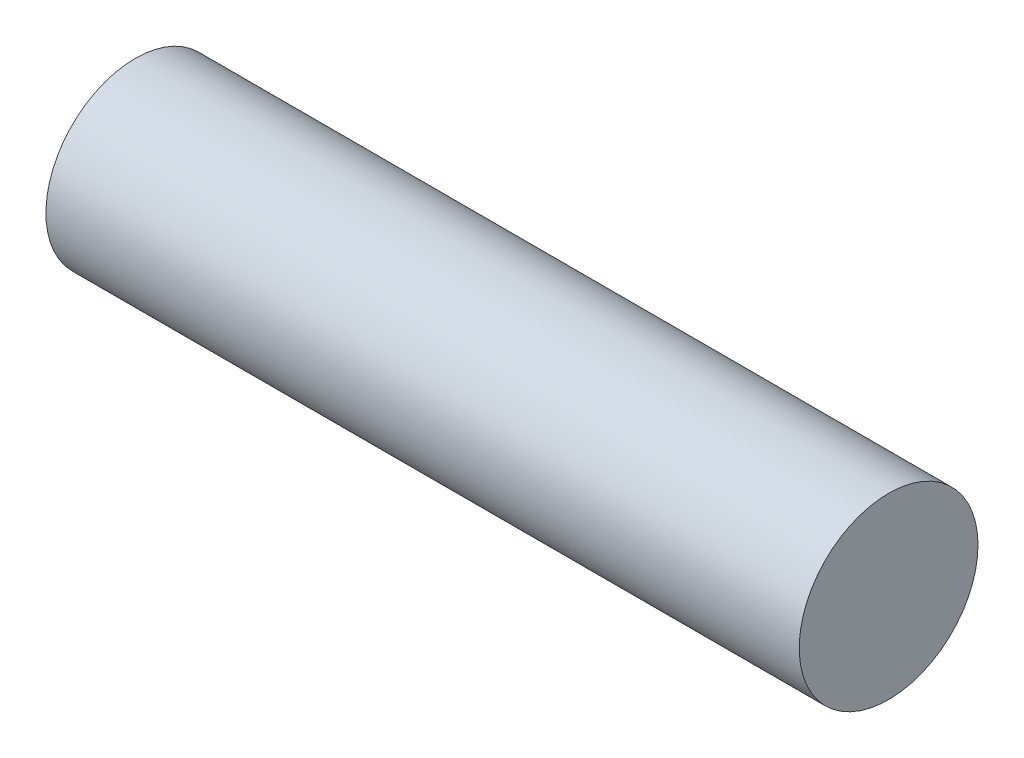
ISO-10303-21;
HEADER;
FILE_DESCRIPTION(('STEP AP214'),'2;1');
FILE_NAME('part.step','',(''),(''),'','','');
FILE_SCHEMA(('AUTOMOTIVE_DESIGN { 1 0 10303 214 1 1 1 1 }'));
ENDSEC;
DATA;
#1=APPLICATION_CONTEXT('core data for automotive mechanical design processes');
#2=APPLICATION_PROTOCOL_DEFINITION('international standard','automotive_design',2000,#1);
#3=PRODUCT_CONTEXT('',#1,'mechanical');
#4=PRODUCT('Part','Part','',(#3));
#5=PRODUCT_RELATED_PRODUCT_CATEGORY('part','',(#4));
#6=PRODUCT_DEFINITION_FORMATION('','',#4);
#7=PRODUCT_DEFINITION_CONTEXT('part definition',#1,'design');
#8=PRODUCT_DEFINITION('design','',#6,#7);
#9=PRODUCT_DEFINITION_SHAPE('','',#8);
#10=(LENGTH_UNIT() NAMED_UNIT(*) SI_UNIT(.MILLI.,.METRE.));
#11=(NAMED_UNIT(*) PLANE_ANGLE_UNIT() SI_UNIT($,.RADIAN.));
#12=(NAMED_UNIT(*) SI_UNIT($,.STERADIAN.) SOLID_ANGLE_UNIT());
#13=UNCERTAINTY_MEASURE_WITH_UNIT(LENGTH_MEASURE(1.E-05),#10,'distance_accuracy_value','');
#14=(GEOMETRIC_REPRESENTATION_CONTEXT(3) GLOBAL_UNCERTAINTY_ASSIGNED_CONTEXT((#13)) GLOBAL_UNIT_ASSIGNED_CONTEXT((#10,
#11,#12)) REPRESENTATION_CONTEXT('',''));
#15=CARTESIAN_POINT('',(0.,0.,0.));
#16=DIRECTION('',(0.,0.,1.));
#17=DIRECTION('',(1.,0.,0.));
#18=AXIS2_PLACEMENT_3D('',#15,#16,#17);
#19=CARTESIAN_POINT('',(0.,0.,0.));
#20=DIRECTION('',(1.,0.,0.));
#21=DIRECTION('',(0.,0.,-1.));
#22=AXIS2_PLACEMENT_3D('',#19,#20,#21);
#23=CYLINDRICAL_SURFACE('',#22,1.25);
#24=CARTESIAN_POINT('',(1.90975432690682,0.,0.));
#25=DIRECTION('',(1.,0.,0.));
#26=DIRECTION('',(0.,0.,-1.));
#27=AXIS2_PLACEMENT_3D('',#24,#25,#26);
#28=CIRCLE('',#27,1.25);
#29=CARTESIAN_POINT('',(1.90975432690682,0.,-1.24999999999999));
#30=VERTEX_POINT('',#29);
#31=EDGE_CURVE('E10',#30,#30,#28,.T.);
#32=ORIENTED_EDGE('',*,*,#31,.T.);
#33=EDGE_LOOP('',(#32));
#34=FACE_BOUND('',#33,.T.);
#35=CARTESIAN_POINT('',(12.445,0.,0.));
#36=DIRECTION('',(1.,0.,0.));
#37=DIRECTION('',(0.,0.,-1.));
#38=AXIS2_PLACEMENT_3D('',#35,#36,#37);
#39=CIRCLE('',#38,1.25);
#40=CARTESIAN_POINT('',(12.445,0.,-1.25000000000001));
#41=VERTEX_POINT('',#40);
#42=EDGE_CURVE('E41',#41,#41,#39,.T.);
#43=ORIENTED_EDGE('',*,*,#42,.F.);
#44=EDGE_LOOP('',(#43));
#45=FACE_BOUND('',#44,.T.);
#46=ADVANCED_FACE('F34',(#34,#45),#23,.T.);
#47=CARTESIAN_POINT('',(-0.145699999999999,0.,0.));
#48=DIRECTION('',(1.,0.,0.));
#49=DIRECTION('',(0.,1.,0.));
#50=AXIS2_PLACEMENT_3D('',#47,#48,#49);
#51=SPHERICAL_SURFACE('',#50,2.4057);
#52=ORIENTED_EDGE('',*,*,#31,.F.);
#53=EDGE_LOOP('',(#52));
#54=FACE_BOUND('',#53,.T.);
#55=ADVANCED_FACE('F51',(#54),#51,.F.);
#56=CARTESIAN_POINT('',(12.445,1.24999999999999,0.));
#57=DIRECTION('',(1.,0.,0.));
#58=DIRECTION('',(0.,0.,-1.));
#59=AXIS2_PLACEMENT_3D('',#56,#57,#58);
#60=PLANE('',#59);
#61=ORIENTED_EDGE('',*,*,#42,.T.);
#62=EDGE_LOOP('',(#61));
#63=FACE_BOUND('',#62,.T.);
#64=ADVANCED_FACE('F48',(#63),#60,.T.);
#65=CLOSED_SHELL('',(#46,#55,#64));
#66=MANIFOLD_SOLID_BREP('B2',#65);
#67=ADVANCED_BREP_SHAPE_REPRESENTATION('',(#18,#66),#14);
#68=SHAPE_DEFINITION_REPRESENTATION(#9,#67);
ENDSEC;
END-ISO-10303-21;
